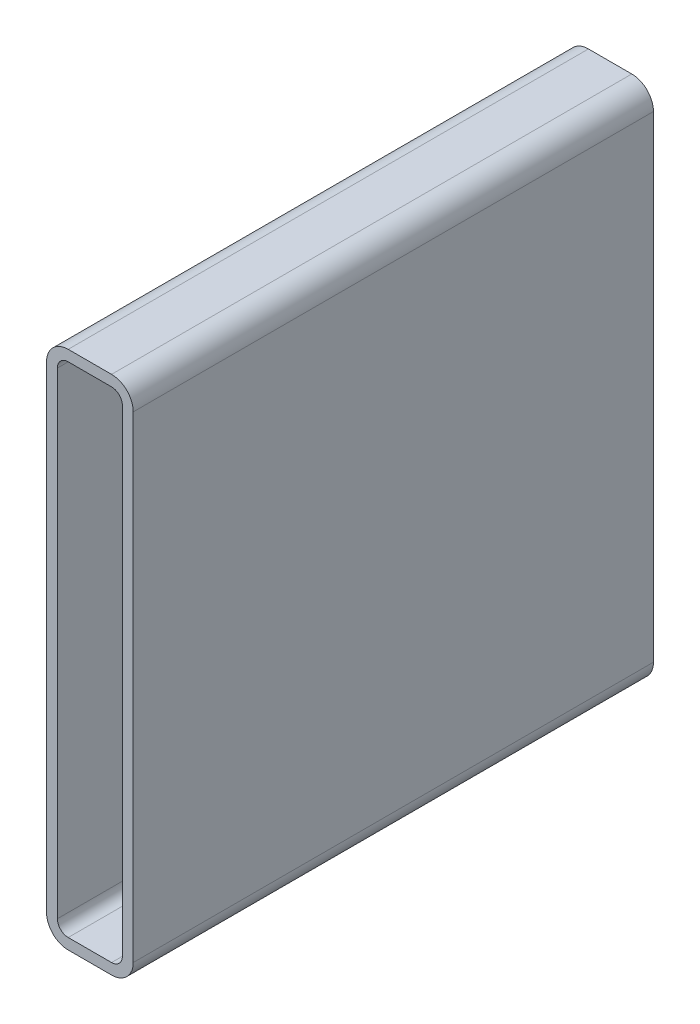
from build123d import *

# Parameters (mm, degrees)
BOSS_EXTRUDE1_DEPTH = 304.8


with BuildPart() as part:
    # Sketch1 → Boss-Extrude1 (new body)
    with BuildSketch(Plane.XY):
        with BuildLine():
            Line((12.7, 304.8), (38.1, 304.8))
            ThreePointArc((38.1, 304.8), (47.080256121, 301.080256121), (50.8, 292.1))
            Line((50.8, 292.1), (50.8, 12.7))
            ThreePointArc((50.8, 12.7), (47.080256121, 3.719743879), (38.1, 0))
            Line((38.1, 0), (12.7, 0))
            ThreePointArc((12.7, 0), (3.719743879, 3.719743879), (0, 12.7))
            Line((0, 12.7), (0, 292.1))
            ThreePointArc((0, 292.1), (3.719743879, 301.080256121), (12.7, 304.8))
        make_face()
        with BuildLine():
            Line((12.7, 298.45), (38.1, 298.45))
            ThreePointArc((38.1, 298.45), (42.590128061, 296.590128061), (44.45, 292.1))
            Line((44.45, 292.1), (44.45, 12.7))
            ThreePointArc((44.45, 12.7), (42.590128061, 8.209871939), (38.1, 6.35))
            Line((38.1, 6.35), (12.7, 6.35))
            ThreePointArc((12.7, 6.35), (8.209871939, 8.209871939), (6.35, 12.7))
            Line((6.35, 12.7), (6.35, 292.1))
            ThreePointArc((6.35, 292.1), (8.209871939, 296.590128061), (12.7, 298.45))
        make_face(mode=Mode.SUBTRACT)
    extrude(amount=BOSS_EXTRUDE1_DEPTH)


solid = part.part
